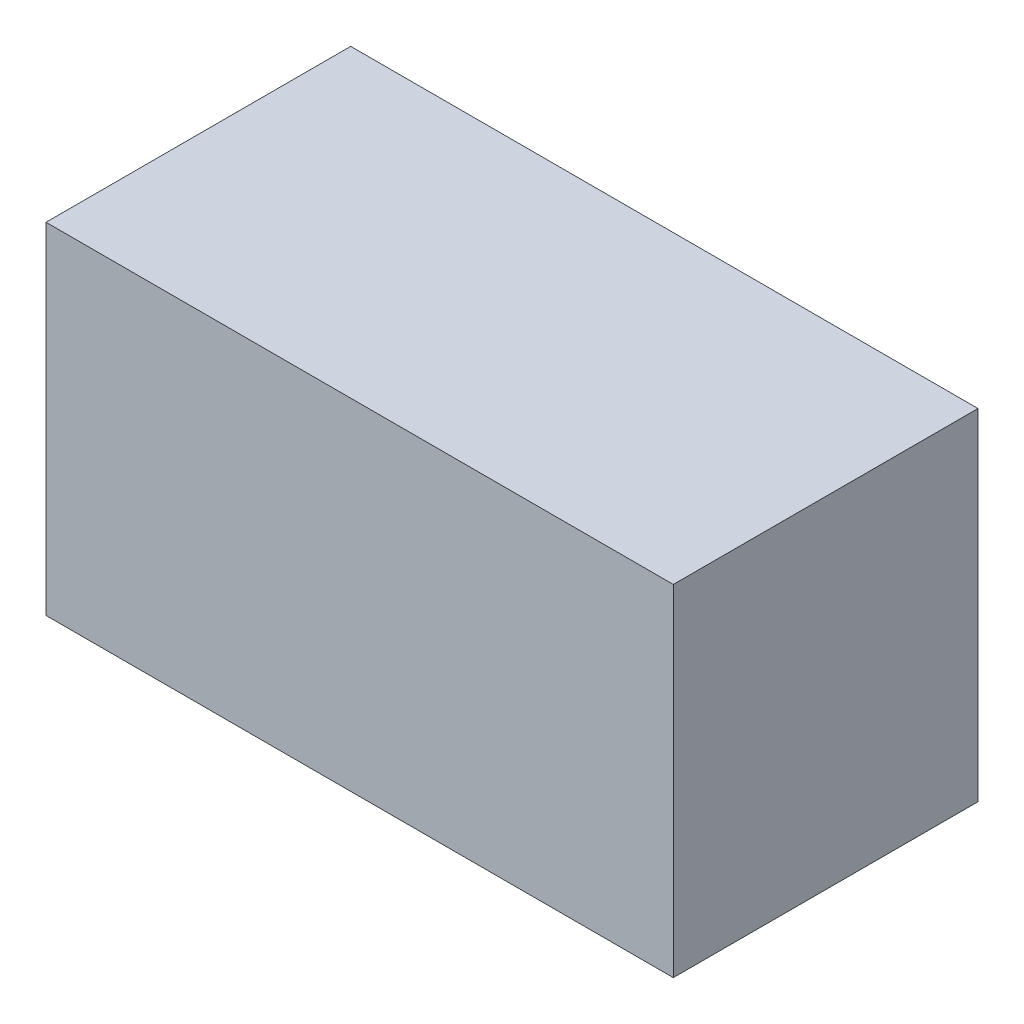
ISO-10303-21;
HEADER;
FILE_DESCRIPTION(('STEP AP214'),'2;1');
FILE_NAME('part.step','',(''),(''),'','','');
FILE_SCHEMA(('AUTOMOTIVE_DESIGN { 1 0 10303 214 1 1 1 1 }'));
ENDSEC;
DATA;
#1=APPLICATION_CONTEXT('core data for automotive mechanical design processes');
#2=APPLICATION_PROTOCOL_DEFINITION('international standard','automotive_design',2000,#1);
#3=PRODUCT_CONTEXT('',#1,'mechanical');
#4=PRODUCT('Part','Part','',(#3));
#5=PRODUCT_RELATED_PRODUCT_CATEGORY('part','',(#4));
#6=PRODUCT_DEFINITION_FORMATION('','',#4);
#7=PRODUCT_DEFINITION_CONTEXT('part definition',#1,'design');
#8=PRODUCT_DEFINITION('design','',#6,#7);
#9=PRODUCT_DEFINITION_SHAPE('','',#8);
#10=(LENGTH_UNIT() NAMED_UNIT(*) SI_UNIT(.MILLI.,.METRE.));
#11=(NAMED_UNIT(*) PLANE_ANGLE_UNIT() SI_UNIT($,.RADIAN.));
#12=(NAMED_UNIT(*) SI_UNIT($,.STERADIAN.) SOLID_ANGLE_UNIT());
#13=UNCERTAINTY_MEASURE_WITH_UNIT(LENGTH_MEASURE(1.E-05),#10,'distance_accuracy_value','');
#14=(GEOMETRIC_REPRESENTATION_CONTEXT(3) GLOBAL_UNCERTAINTY_ASSIGNED_CONTEXT((#13)) GLOBAL_UNIT_ASSIGNED_CONTEXT((#10,
#11,#12)) REPRESENTATION_CONTEXT('',''));
#15=CARTESIAN_POINT('',(0.,0.,0.));
#16=DIRECTION('',(0.,0.,1.));
#17=DIRECTION('',(1.,0.,0.));
#18=AXIS2_PLACEMENT_3D('',#15,#16,#17);
#19=CARTESIAN_POINT('',(0.87499952,-0.47500032,0.85));
#20=DIRECTION('',(0.,0.,1.));
#21=DIRECTION('',(1.,0.,0.));
#22=AXIS2_PLACEMENT_3D('',#19,#20,#21);
#23=PLANE('',#22);
#24=DIRECTION('',(0.,1.,0.));
#25=VECTOR('',#24,1.);
#26=CARTESIAN_POINT('',(-0.87499952,-0.47500032,0.85));
#27=LINE('',#26,#25);
#28=CARTESIAN_POINT('',(-0.87499952,-0.47500032,0.85));
#29=VERTEX_POINT('',#28);
#30=CARTESIAN_POINT('',(-0.87499952,0.47500032,0.85));
#31=VERTEX_POINT('',#30);
#32=EDGE_CURVE('E53',#29,#31,#27,.T.);
#33=ORIENTED_EDGE('',*,*,#32,.F.);
#34=DIRECTION('',(1.,0.,0.));
#35=VECTOR('',#34,1.);
#36=CARTESIAN_POINT('',(0.87499952,-0.47500032,0.85));
#37=LINE('',#36,#35);
#38=CARTESIAN_POINT('',(0.87499952,-0.47500032,0.85));
#39=VERTEX_POINT('',#38);
#40=EDGE_CURVE('E68',#39,#29,#37,.F.);
#41=ORIENTED_EDGE('',*,*,#40,.F.);
#42=DIRECTION('',(0.,1.,0.));
#43=VECTOR('',#42,1.);
#44=CARTESIAN_POINT('',(0.87499952,0.47500032,0.85));
#45=LINE('',#44,#43);
#46=CARTESIAN_POINT('',(0.87499952,0.47500032,0.85));
#47=VERTEX_POINT('',#46);
#48=EDGE_CURVE('E20',#47,#39,#45,.F.);
#49=ORIENTED_EDGE('',*,*,#48,.F.);
#50=DIRECTION('',(1.,0.,0.));
#51=VECTOR('',#50,1.);
#52=CARTESIAN_POINT('',(-0.87499952,0.47500032,0.85));
#53=LINE('',#52,#51);
#54=EDGE_CURVE('E58',#31,#47,#53,.T.);
#55=ORIENTED_EDGE('',*,*,#54,.F.);
#56=EDGE_LOOP('',(#33,#41,#49,#55));
#57=FACE_BOUND('',#56,.T.);
#58=ADVANCED_FACE('F17',(#57),#23,.T.);
#59=CARTESIAN_POINT('',(0.87499952,0.47500032,0.));
#60=DIRECTION('',(1.,0.,0.));
#61=DIRECTION('',(0.,0.,-1.));
#62=AXIS2_PLACEMENT_3D('',#59,#60,#61);
#63=PLANE('',#62);
#64=DIRECTION('',(0.,0.,-1.));
#65=VECTOR('',#64,1.);
#66=CARTESIAN_POINT('',(0.87499952,-0.47500032,0.));
#67=LINE('',#66,#65);
#68=CARTESIAN_POINT('',(0.87499952,-0.47500032,0.));
#69=VERTEX_POINT('',#68);
#70=EDGE_CURVE('E79',#69,#39,#67,.F.);
#71=ORIENTED_EDGE('',*,*,#70,.F.);
#72=DIRECTION('',(0.,1.,0.));
#73=VECTOR('',#72,1.);
#74=CARTESIAN_POINT('',(0.87499952,-0.47500032,0.));
#75=LINE('',#74,#73);
#76=CARTESIAN_POINT('',(0.87499952,0.47500032,0.));
#77=VERTEX_POINT('',#76);
#78=EDGE_CURVE('E74',#69,#77,#75,.T.);
#79=ORIENTED_EDGE('',*,*,#78,.T.);
#80=DIRECTION('',(0.,0.,1.));
#81=VECTOR('',#80,1.);
#82=CARTESIAN_POINT('',(0.87499952,0.47500032,0.));
#83=LINE('',#82,#81);
#84=EDGE_CURVE('E63',#47,#77,#83,.F.);
#85=ORIENTED_EDGE('',*,*,#84,.F.);
#86=ORIENTED_EDGE('',*,*,#48,.T.);
#87=EDGE_LOOP('',(#71,#79,#85,#86));
#88=FACE_BOUND('',#87,.T.);
#89=ADVANCED_FACE('F73',(#88),#63,.T.);
#90=CARTESIAN_POINT('',(-0.87499952,0.47500032,0.));
#91=DIRECTION('',(0.,1.,0.));
#92=DIRECTION('',(0.,0.,1.));
#93=AXIS2_PLACEMENT_3D('',#90,#91,#92);
#94=PLANE('',#93);
#95=ORIENTED_EDGE('',*,*,#84,.T.);
#96=DIRECTION('',(1.,0.,0.));
#97=VECTOR('',#96,1.);
#98=CARTESIAN_POINT('',(0.87499952,0.47500032,0.));
#99=LINE('',#98,#97);
#100=CARTESIAN_POINT('',(-0.87499952,0.47500032,0.));
#101=VERTEX_POINT('',#100);
#102=EDGE_CURVE('E84',#77,#101,#99,.F.);
#103=ORIENTED_EDGE('',*,*,#102,.T.);
#104=DIRECTION('',(0.,0.,1.));
#105=VECTOR('',#104,1.);
#106=CARTESIAN_POINT('',(-0.87499952,0.47500032,0.));
#107=LINE('',#106,#105);
#108=EDGE_CURVE('E65',#31,#101,#107,.F.);
#109=ORIENTED_EDGE('',*,*,#108,.F.);
#110=ORIENTED_EDGE('',*,*,#54,.T.);
#111=EDGE_LOOP('',(#95,#103,#109,#110));
#112=FACE_BOUND('',#111,.T.);
#113=ADVANCED_FACE('F60',(#112),#94,.T.);
#114=CARTESIAN_POINT('',(-0.87499952,-0.47500032,0.));
#115=DIRECTION('',(-1.,0.,0.));
#116=DIRECTION('',(0.,0.,1.));
#117=AXIS2_PLACEMENT_3D('',#114,#115,#116);
#118=PLANE('',#117);
#119=ORIENTED_EDGE('',*,*,#108,.T.);
#120=DIRECTION('',(0.,1.,0.));
#121=VECTOR('',#120,1.);
#122=CARTESIAN_POINT('',(-0.87499952,-0.47500032,0.));
#123=LINE('',#122,#121);
#124=CARTESIAN_POINT('',(-0.87499952,-0.47500032,0.));
#125=VERTEX_POINT('',#124);
#126=EDGE_CURVE('E26',#101,#125,#123,.F.);
#127=ORIENTED_EDGE('',*,*,#126,.T.);
#128=DIRECTION('',(0.,0.,-1.));
#129=VECTOR('',#128,1.);
#130=CARTESIAN_POINT('',(-0.87499952,-0.47500032,0.));
#131=LINE('',#130,#129);
#132=EDGE_CURVE('E34',#29,#125,#131,.T.);
#133=ORIENTED_EDGE('',*,*,#132,.F.);
#134=ORIENTED_EDGE('',*,*,#32,.T.);
#135=EDGE_LOOP('',(#119,#127,#133,#134));
#136=FACE_BOUND('',#135,.T.);
#137=ADVANCED_FACE('F88',(#136),#118,.T.);
#138=CARTESIAN_POINT('',(0.87499952,-0.47500032,0.));
#139=DIRECTION('',(0.,-1.,0.));
#140=DIRECTION('',(0.,0.,-1.));
#141=AXIS2_PLACEMENT_3D('',#138,#139,#140);
#142=PLANE('',#141);
#143=ORIENTED_EDGE('',*,*,#132,.T.);
#144=DIRECTION('',(1.,0.,0.));
#145=VECTOR('',#144,1.);
#146=CARTESIAN_POINT('',(0.87499952,-0.47500032,0.));
#147=LINE('',#146,#145);
#148=EDGE_CURVE('E11',#125,#69,#147,.T.);
#149=ORIENTED_EDGE('',*,*,#148,.T.);
#150=ORIENTED_EDGE('',*,*,#70,.T.);
#151=ORIENTED_EDGE('',*,*,#40,.T.);
#152=EDGE_LOOP('',(#143,#149,#150,#151));
#153=FACE_BOUND('',#152,.T.);
#154=ADVANCED_FACE('F91',(#153),#142,.T.);
#155=CARTESIAN_POINT('',(0.87499952,-0.47500032,0.));
#156=DIRECTION('',(0.,0.,1.));
#157=DIRECTION('',(1.,0.,0.));
#158=AXIS2_PLACEMENT_3D('',#155,#156,#157);
#159=PLANE('',#158);
#160=ORIENTED_EDGE('',*,*,#126,.F.);
#161=ORIENTED_EDGE('',*,*,#102,.F.);
#162=ORIENTED_EDGE('',*,*,#78,.F.);
#163=ORIENTED_EDGE('',*,*,#148,.F.);
#164=EDGE_LOOP('',(#160,#161,#162,#163));
#165=FACE_BOUND('',#164,.T.);
#166=ADVANCED_FACE('F90',(#165),#159,.F.);
#167=CLOSED_SHELL('',(#58,#89,#113,#137,#154,#166));
#168=MANIFOLD_SOLID_BREP('B1',#167);
#169=ADVANCED_BREP_SHAPE_REPRESENTATION('',(#18,#168),#14);
#170=SHAPE_DEFINITION_REPRESENTATION(#9,#169);
ENDSEC;
END-ISO-10303-21;
